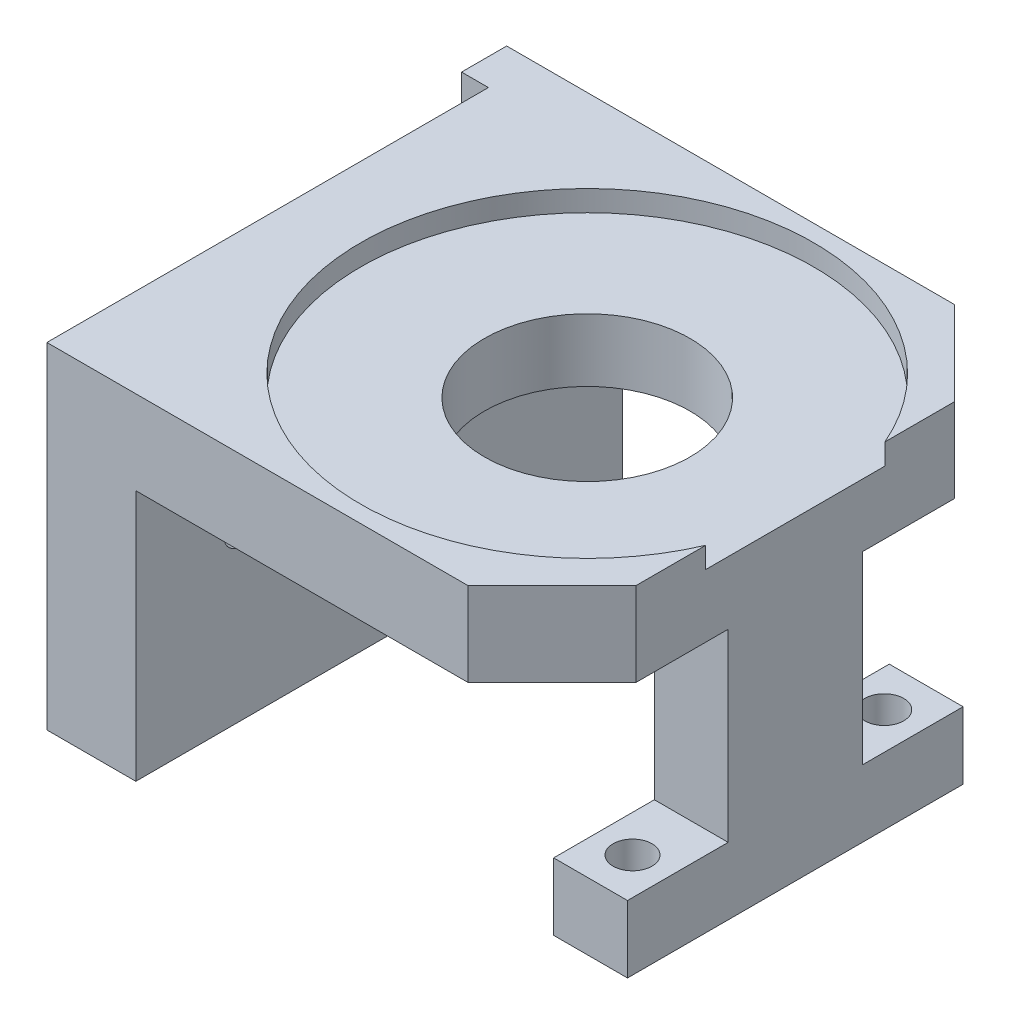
from build123d import *

# Parameters (mm, degrees)
SKETCH1_W                 = 38.227
SKETCH1_H                 = 36.83
BOSS_EXTRUDE1_DEPTH       = 6.35
SKETCH2_W                 = 6.731
SKETCH2_H                 = 36.83
SKETCH2_W_2               = 5.588
SKETCH2_H_2               = 10.16
BOSS_EXTRUDE2_DEPTH       = 19.05
SKETCH3_W                 = 5.588
SKETCH3_H                 = 25.4
BOSS_EXTRUDE3_DEPTH       = 5.08
SKETCH4_W                 = 3.415000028
SKETCH4_H                 = 25.4
BOSS_EXTRUDE4_DEPTH       = 2.032
SKETCH5_R                 = 7.77875
CUT_EXTRUDE1_DEPTH        = 6.35
CHAMFER1_SIZE             = 6.35
F_8_32_TAPPED_HOLE1_D     = 3.4544
F_8_32_TAPPED_HOLE1_DEPTH = 10.16
M3X0_5_TAPPED_HOLE1_D     = 2.5
M3X0_5_TAPPED_HOLE1_DEPTH = 7.493
F_4_CLEARANCE_HOLE1_D     = 2.9464
F_4_CLEARANCE_HOLE1_DEPTH = 8.255
F_4_40_TAPPED_HOLE1_D     = 2.2606
F_4_40_TAPPED_HOLE1_DEPTH = 7.5946
SKETCH14_R                = 17.145
CUT_EXTRUDE2_DEPTH        = 1.5875


with BuildPart() as part:
    # Sketch1 → Boss-Extrude1 (new body)
    with BuildSketch(Plane(origin=(0, 0, 0), x_dir=(1, 0, 0), z_dir=(0, 1, 0))):
        with Locations((-3.3655, 0)):
            Rectangle(SKETCH1_W, SKETCH1_H)
    extrude(amount=-BOSS_EXTRUDE1_DEPTH)

    # Sketch2 → Boss-Extrude2 (add)
    with BuildSketch(Plane.XZ.offset(6.35)):
        with Locations((-19.1135, 0)):
            Rectangle(SKETCH2_W, SKETCH2_H)
        with Locations((12.954, 0)):
            Rectangle(SKETCH2_W_2, SKETCH2_H_2)
    extrude(amount=BOSS_EXTRUDE2_DEPTH)

    # Sketch3 → Boss-Extrude3 (add)
    with BuildSketch(Plane.XZ.offset(25.4)):
        with Locations((12.954, 0)):
            Rectangle(SKETCH3_W, SKETCH3_H)
    extrude(amount=-BOSS_EXTRUDE3_DEPTH)

    # Sketch4 → Boss-Extrude4 (add)
    with BuildSketch(Plane.ZY.offset(22.479)):
        with Locations((-16.707499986, -12.7)):
            Rectangle(SKETCH4_W, SKETCH4_H)
    extrude(amount=BOSS_EXTRUDE4_DEPTH)

    # Sketch5 → Cut-Extrude1 (cut)
    with BuildSketch(Plane(origin=(0, 0, 0), x_dir=(1, 0, 0), z_dir=(0, 1, 0))):
        with Locations(Location((0, 0, 0), (0, 0, 270))):
            Circle(SKETCH5_R)
    extrude(amount=-CUT_EXTRUDE1_DEPTH, mode=Mode.SUBTRACT)

    # Chamfer1
    chamfer1_edges = [part.edges().sort_by_distance(p)[0] for p in [
        (15.748, -3.175, -18.415),
        (15.748, -3.175, 18.415),
    ]]
    chamfer(chamfer1_edges, length=CHAMFER1_SIZE)

    # 8-32 Tapped Hole1
    with Locations(Plane(origin=(0, 0, -18.415), x_dir=(-1, 0, 0), z_dir=(0, 0, -1))):
        with Locations((19.424650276, -3.175), (19.424650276, -22.225)):
            Hole(F_8_32_TAPPED_HOLE1_D / 2, depth=F_8_32_TAPPED_HOLE1_DEPTH)

    # M3x0.5 Tapped Hole1
    with Locations(Plane(origin=(-15.748, 0, 0), x_dir=(0, 0, -1), z_dir=(1, 0, 0))):
        with Locations((-10.5, -12.7), (10.5, -12.7)):
            Hole(M3X0_5_TAPPED_HOLE1_D / 2, depth=M3X0_5_TAPPED_HOLE1_DEPTH)

    # 4 Clearance Hole1
    with Locations(Plane(origin=(0, -25.4, 0), x_dir=(-1, 0, 0), z_dir=(0, -1, 0))):
        with Locations((-12.954, -9.525), (-12.954, 9.525)):
            Hole(F_4_CLEARANCE_HOLE1_D / 2, depth=F_4_CLEARANCE_HOLE1_DEPTH)

    # 4-40 Tapped Hole1
    with Locations(Plane(origin=(0, -25.4, 0), x_dir=(-1, 0, 0), z_dir=(0, -1, 0))):
        with Locations((19.1135, -6.985), (19.1135, 6.985)):
            Hole(F_4_40_TAPPED_HOLE1_D / 2, depth=F_4_40_TAPPED_HOLE1_DEPTH)

    # Sketch14 → Cut-Extrude2 (cut)
    with BuildSketch(Plane(origin=(0, 0, 0), x_dir=(1, 0, 0), z_dir=(0, 1, 0))):
        Circle(SKETCH14_R)
    extrude(amount=-CUT_EXTRUDE2_DEPTH, mode=Mode.SUBTRACT)


solid = part.part
